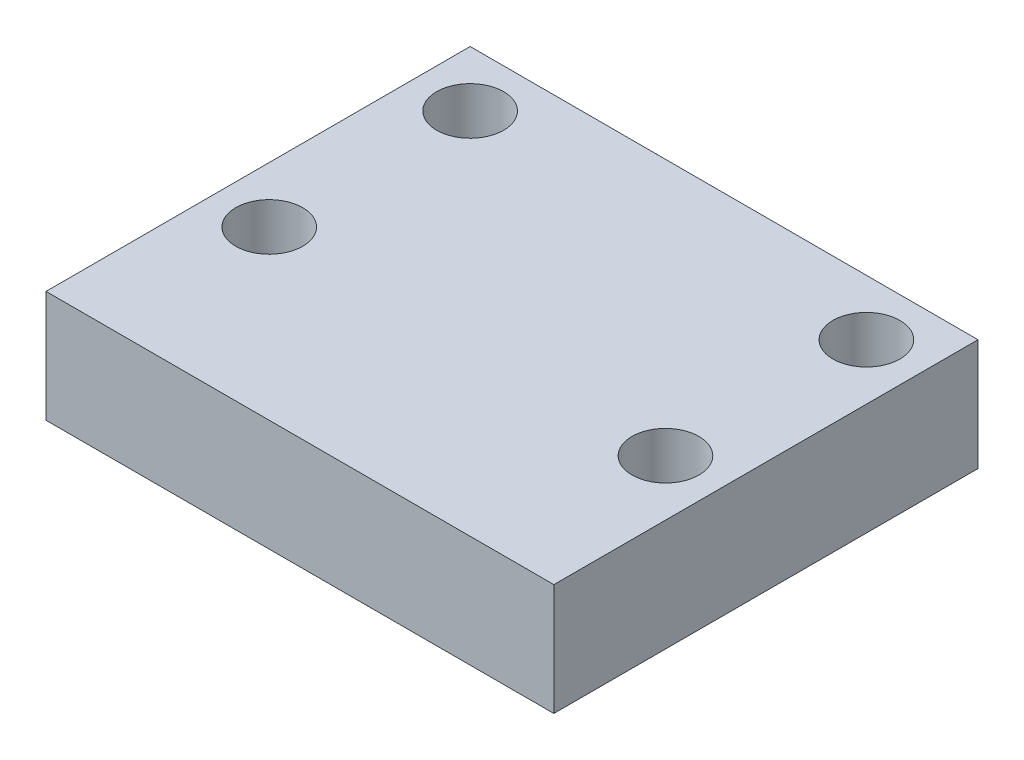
from build123d import *

# Parameters (mm, degrees)
SKETCH1_W           = 45.5
SKETCH1_H           = 38
SKETCH1_R           = 2
BOSS_EXTRUDE1_DEPTH = 10
SKETCH2_R           = 3
CUT_EXTRUDE1_DEPTH  = 32.281983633


with BuildPart() as part:
    # Sketch1 → Boss-Extrude1 (new body)
    with BuildSketch(Plane(origin=(0, 0, 0), x_dir=(1, 0, 0), z_dir=(0, 1, 0))):
        Rectangle(SKETCH1_W, SKETCH1_H)
        with Locations(Location((-17.75, 14, 0), (0, 0, 270))):
            Circle(SKETCH1_R, mode=Mode.SUBTRACT)
        with Locations(Location((-17.75, -4, 0), (0, 0, 270))):
            Circle(SKETCH1_R, mode=Mode.SUBTRACT)
        with Locations(Location((17.75, 14, 0), (0, 0, 270))):
            Circle(SKETCH1_R, mode=Mode.SUBTRACT)
        with Locations(Location((17.75, -4, 0), (0, 0, 270))):
            Circle(SKETCH1_R, mode=Mode.SUBTRACT)
    extrude(amount=BOSS_EXTRUDE1_DEPTH)

    # Sketch2 → Cut-Extrude1 (cut, through all)
    with BuildSketch(Plane.XZ):
        with Locations(Location((-17.75, 4, 0), (0, 0, 270))):
            Circle(SKETCH2_R)
        with Locations(Location((-17.75, -14, 0), (0, 0, 270))):
            Circle(SKETCH2_R)
        with Locations(Location((17.75, -14, 0), (0, 0, 90))):
            Circle(SKETCH2_R)
        with Locations(Location((17.75, 4, 0), (0, 0, 90))):
            Circle(SKETCH2_R)
    extrude(amount=-CUT_EXTRUDE1_DEPTH, mode=Mode.SUBTRACT)


solid = part.part
